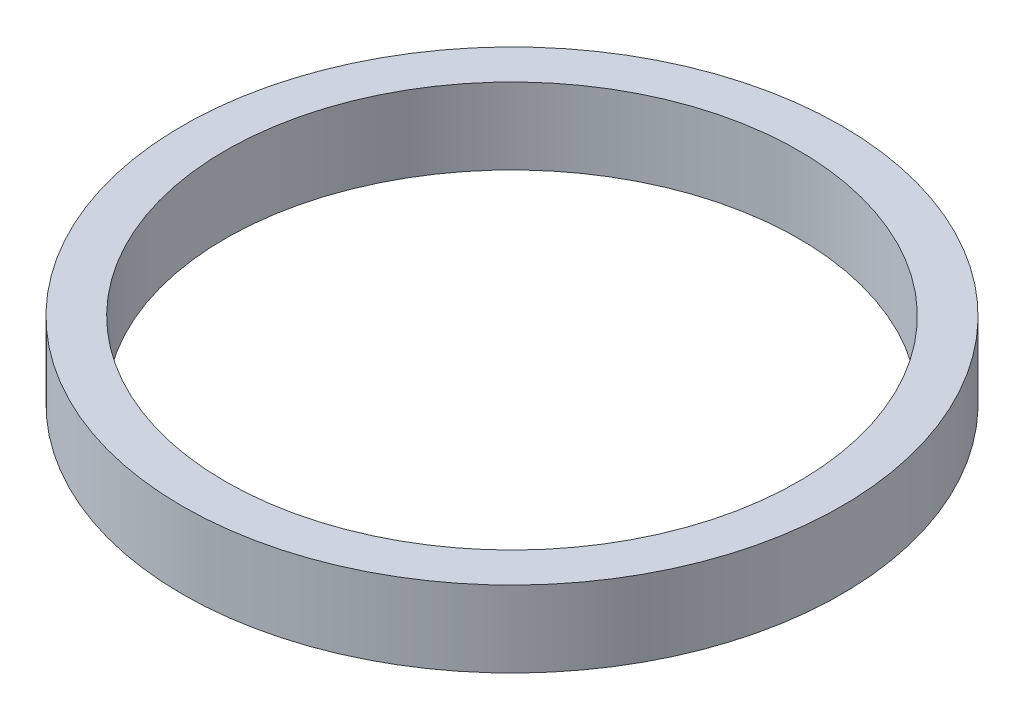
ISO-10303-21;
HEADER;
FILE_DESCRIPTION(('STEP AP214'),'2;1');
FILE_NAME('part.step','',(''),(''),'','','');
FILE_SCHEMA(('AUTOMOTIVE_DESIGN { 1 0 10303 214 1 1 1 1 }'));
ENDSEC;
DATA;
#1=APPLICATION_CONTEXT('core data for automotive mechanical design processes');
#2=APPLICATION_PROTOCOL_DEFINITION('international standard','automotive_design',2000,#1);
#3=PRODUCT_CONTEXT('',#1,'mechanical');
#4=PRODUCT('Part','Part','',(#3));
#5=PRODUCT_RELATED_PRODUCT_CATEGORY('part','',(#4));
#6=PRODUCT_DEFINITION_FORMATION('','',#4);
#7=PRODUCT_DEFINITION_CONTEXT('part definition',#1,'design');
#8=PRODUCT_DEFINITION('design','',#6,#7);
#9=PRODUCT_DEFINITION_SHAPE('','',#8);
#10=(LENGTH_UNIT() NAMED_UNIT(*) SI_UNIT(.MILLI.,.METRE.));
#11=(NAMED_UNIT(*) PLANE_ANGLE_UNIT() SI_UNIT($,.RADIAN.));
#12=(NAMED_UNIT(*) SI_UNIT($,.STERADIAN.) SOLID_ANGLE_UNIT());
#13=UNCERTAINTY_MEASURE_WITH_UNIT(LENGTH_MEASURE(1.E-05),#10,'distance_accuracy_value','');
#14=(GEOMETRIC_REPRESENTATION_CONTEXT(3) GLOBAL_UNCERTAINTY_ASSIGNED_CONTEXT((#13)) GLOBAL_UNIT_ASSIGNED_CONTEXT((#10,
#11,#12)) REPRESENTATION_CONTEXT('',''));
#15=CARTESIAN_POINT('',(0.,0.,0.));
#16=DIRECTION('',(0.,0.,1.));
#17=DIRECTION('',(1.,0.,0.));
#18=AXIS2_PLACEMENT_3D('',#15,#16,#17);
#19=CARTESIAN_POINT('',(-234.756237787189,30.,-468.327794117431));
#20=DIRECTION('',(0.,1.,0.));
#21=DIRECTION('',(0.,0.,1.));
#22=AXIS2_PLACEMENT_3D('',#19,#20,#21);
#23=PLANE('',#22);
#24=CARTESIAN_POINT('',(-234.756237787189,30.,-468.327794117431));
#25=DIRECTION('',(0.,1.,0.));
#26=DIRECTION('',(0.,0.,1.));
#27=AXIS2_PLACEMENT_3D('',#24,#25,#26);
#28=CIRCLE('',#27,129.784214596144);
#29=CARTESIAN_POINT('',(-234.756237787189,30.,-338.543579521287));
#30=VERTEX_POINT('',#29);
#31=EDGE_CURVE('E10',#30,#30,#28,.T.);
#32=ORIENTED_EDGE('',*,*,#31,.T.);
#33=EDGE_LOOP('',(#32));
#34=FACE_BOUND('',#33,.T.);
#35=CARTESIAN_POINT('',(-234.756237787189,30.,-468.327794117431));
#36=DIRECTION('',(0.,1.,0.));
#37=DIRECTION('',(0.,0.,1.));
#38=AXIS2_PLACEMENT_3D('',#35,#36,#37);
#39=CIRCLE('',#38,112.883971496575);
#40=CARTESIAN_POINT('',(-234.756237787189,30.,-355.443822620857));
#41=VERTEX_POINT('',#40);
#42=EDGE_CURVE('E42',#41,#41,#39,.T.);
#43=ORIENTED_EDGE('',*,*,#42,.F.);
#44=EDGE_LOOP('',(#43));
#45=FACE_BOUND('',#44,.T.);
#46=ADVANCED_FACE('F31',(#34,#45),#23,.T.);
#47=CARTESIAN_POINT('',(-234.756237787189,0.,-468.327794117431));
#48=DIRECTION('',(0.,1.,0.));
#49=DIRECTION('',(0.,0.,1.));
#50=AXIS2_PLACEMENT_3D('',#47,#48,#49);
#51=PLANE('',#50);
#52=CARTESIAN_POINT('',(-234.756237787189,0.,-468.327794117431));
#53=DIRECTION('',(0.,1.,0.));
#54=DIRECTION('',(0.,0.,1.));
#55=AXIS2_PLACEMENT_3D('',#52,#53,#54);
#56=CIRCLE('',#55,129.784214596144);
#57=CARTESIAN_POINT('',(-234.756237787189,0.,-338.543579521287));
#58=VERTEX_POINT('',#57);
#59=EDGE_CURVE('E35',#58,#58,#56,.T.);
#60=ORIENTED_EDGE('',*,*,#59,.F.);
#61=EDGE_LOOP('',(#60));
#62=FACE_BOUND('',#61,.T.);
#63=CARTESIAN_POINT('',(-234.756237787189,0.,-468.327794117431));
#64=DIRECTION('',(0.,1.,0.));
#65=DIRECTION('',(0.,0.,1.));
#66=AXIS2_PLACEMENT_3D('',#63,#64,#65);
#67=CIRCLE('',#66,112.883971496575);
#68=CARTESIAN_POINT('',(-234.756237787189,0.,-355.443822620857));
#69=VERTEX_POINT('',#68);
#70=EDGE_CURVE('E44',#69,#69,#67,.T.);
#71=ORIENTED_EDGE('',*,*,#70,.T.);
#72=EDGE_LOOP('',(#71));
#73=FACE_BOUND('',#72,.T.);
#74=ADVANCED_FACE('F54',(#62,#73),#51,.F.);
#75=CARTESIAN_POINT('',(-234.756237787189,30.,-468.327794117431));
#76=DIRECTION('',(0.,-1.,0.));
#77=DIRECTION('',(0.,0.,-1.));
#78=AXIS2_PLACEMENT_3D('',#75,#76,#77);
#79=CYLINDRICAL_SURFACE('',#78,129.784214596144);
#80=ORIENTED_EDGE('',*,*,#31,.F.);
#81=EDGE_LOOP('',(#80));
#82=FACE_BOUND('',#81,.T.);
#83=ORIENTED_EDGE('',*,*,#59,.T.);
#84=EDGE_LOOP('',(#83));
#85=FACE_BOUND('',#84,.T.);
#86=ADVANCED_FACE('F33',(#82,#85),#79,.T.);
#87=CARTESIAN_POINT('',(-234.756237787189,30.,-468.327794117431));
#88=DIRECTION('',(0.,-1.,0.));
#89=DIRECTION('',(0.,0.,-1.));
#90=AXIS2_PLACEMENT_3D('',#87,#88,#89);
#91=CYLINDRICAL_SURFACE('',#90,112.883971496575);
#92=ORIENTED_EDGE('',*,*,#42,.T.);
#93=EDGE_LOOP('',(#92));
#94=FACE_BOUND('',#93,.T.);
#95=ORIENTED_EDGE('',*,*,#70,.F.);
#96=EDGE_LOOP('',(#95));
#97=FACE_BOUND('',#96,.T.);
#98=ADVANCED_FACE('F50',(#94,#97),#91,.F.);
#99=CLOSED_SHELL('',(#46,#74,#86,#98));
#100=MANIFOLD_SOLID_BREP('B2',#99);
#101=ADVANCED_BREP_SHAPE_REPRESENTATION('',(#18,#100),#14);
#102=SHAPE_DEFINITION_REPRESENTATION(#9,#101);
ENDSEC;
END-ISO-10303-21;
